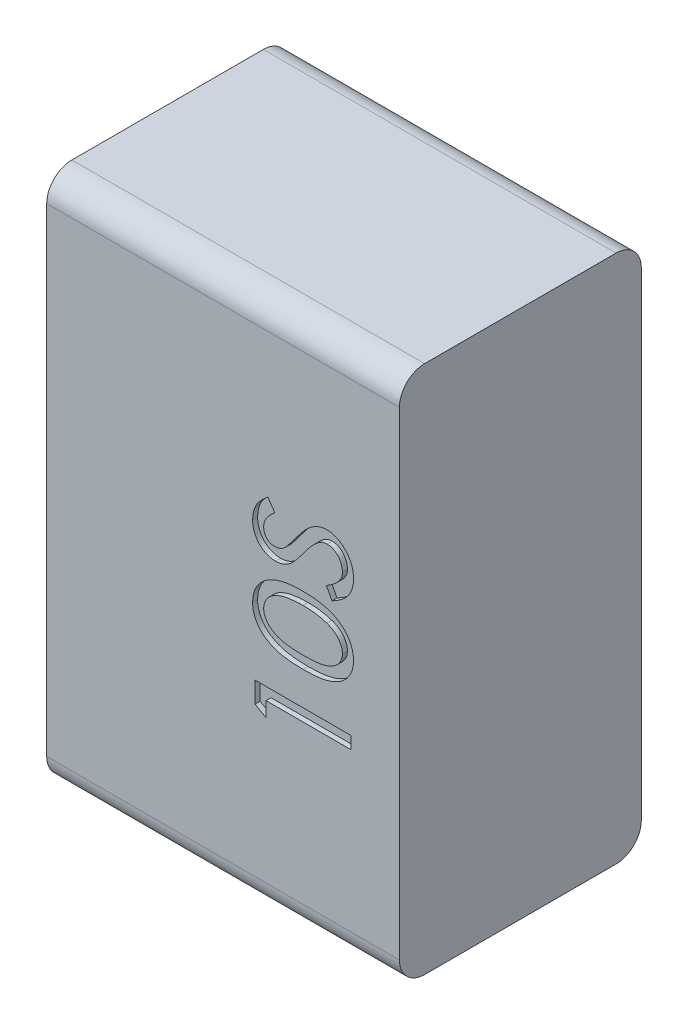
from build123d import *

# Parameters (mm, degrees)
ESQUISSE1_W             = 70
ESQUISSE1_H             = 105
BOSS_EXTRU_1_DEPTH      = 24
CONG_1_R                = 5
ENL_V_MAT_EXTRU_1_DEPTH = 1


with BuildPart() as part:
    # Esquisse1 → Boss.-Extru.1 (new, symmetric)
    with BuildSketch(Plane.XY):
        Rectangle(ESQUISSE1_W, ESQUISSE1_H)
    extrude(amount=BOSS_EXTRU_1_DEPTH, both=True)

    # Cong_1
    cong_1_edges = [part.edges().sort_by_distance(p)[0] for p in [
        (0, -52.5, 24),
        (0, 52.5, 24),
        (0, -52.5, -24),
        (0, 52.5, -24),
    ]]
    fillet(cong_1_edges, radius=CONG_1_R)

    # Esquisse2 → Enl_v. mat.-Extru.1 (cut)
    # profile 1 of 3: a face of its own
    with BuildSketch(Plane.XY.offset(24)):
        with BuildLine():
            Line((21.619497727, 7.537951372), (20.512827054, 9.61391291))
            add(Edge.make_bspline(
                [(20.512827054, 9.61391291), (20.763422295, 9.765199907), (21.242379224, 10.054351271), (21.887591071, 10.529152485), (22.437787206, 11.001233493), (22.8924121, 11.475254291), (23.244163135, 11.957799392), (23.498380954, 12.443942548), (23.658165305, 12.93672643), (23.678046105, 13.269913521), (23.687827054, 13.433834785)],
                knots=[0, 0, 0, 0, 1.354943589, 2.589672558, 3.704607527, 4.708856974, 5.624398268, 6.459549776, 7.242129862, 8, 8, 8, 8], degree=3))
            add(Edge.make_bspline(
                [(23.687827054, 13.433834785), (23.682932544, 13.586874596), (23.673237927, 13.890002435), (23.588383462, 14.335206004), (23.460840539, 14.767507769), (23.27212947, 15.175393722), (23.047993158, 15.553338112), (22.785056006, 15.889877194), (22.482175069, 16.171912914), (22.14883514, 16.405921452), (21.793390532, 16.587849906), (21.425460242, 16.725066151), (21.042657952, 16.802323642), (20.784093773, 16.813232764), (20.654022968, 16.818720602)],
                knots=[0, 0, 0, 0, 1.088997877, 2.156991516, 3.217388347, 4.291818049, 5.34833773, 6.341591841, 7.322247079, 8.284867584, 9.233012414, 10.158731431, 11.073749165, 12, 12, 12, 12], degree=3))
            add(Edge.make_bspline(
                [(20.654022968, 16.818720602), (20.505743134, 16.811237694), (20.206103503, 16.796116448), (19.760985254, 16.674749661), (19.320222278, 16.477506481), (19.045026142, 16.295052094), (18.902430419, 16.200511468)],
                knots=[0, 0, 0, 0, 0.941861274, 1.903286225, 2.913566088, 4, 4, 4, 4], degree=3))
            add(Edge.make_bspline(
                [(18.902430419, 16.200511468), (18.798617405, 16.118774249), (18.580082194, 15.946710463), (18.2513591, 15.655191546), (17.907748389, 15.315903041), (17.556440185, 14.921988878), (17.175181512, 14.494264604), (16.78878867, 14.010828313), (16.383615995, 13.483603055), (16.112139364, 13.11382289), (15.971661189, 12.922476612)],
                knots=[0, 0, 0, 0, 0.718605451, 1.5127255, 2.388525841, 3.34361075, 4.383114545, 5.504804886, 6.708837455, 8, 8, 8, 8], degree=3))
            add(Edge.make_bspline(
                [(15.971661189, 12.922476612), (15.829833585, 12.727381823), (15.557706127, 12.353049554), (15.158766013, 11.825648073), (14.790921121, 11.352781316), (14.453883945, 10.938075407), (14.144725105, 10.581483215), (13.864713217, 10.283755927), (13.621532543, 10.03593072), (13.457909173, 9.902756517), (13.384341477, 9.842879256)],
                knots=[0, 0, 0, 0, 1.435833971, 2.754963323, 3.936484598, 5.002077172, 5.935979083, 6.744956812, 7.435712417, 8, 8, 8, 8], degree=3))
            add(Edge.make_bspline(
                [(13.384341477, 9.842879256), (13.271395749, 9.755466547), (13.049504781, 9.583737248), (12.693577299, 9.36632201), (12.332991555, 9.179241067), (11.964408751, 9.025152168), (11.589006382, 8.905742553), (11.205467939, 8.823594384), (10.815316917, 8.765648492), (10.551732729, 8.761294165), (10.419227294, 8.759105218)],
                knots=[0, 0, 0, 0, 1.064105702, 2.090521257, 3.104283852, 4.09061442, 5.065433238, 6.036507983, 7.012940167, 8, 8, 8, 8], degree=3))
            add(Edge.make_bspline(
                [(10.419227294, 8.759105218), (10.212571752, 8.76595527), (9.803408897, 8.779517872), (9.205179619, 8.902353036), (8.63417238, 9.09827764), (8.095517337, 9.369343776), (7.598546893, 9.712262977), (7.156415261, 10.124741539), (6.770775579, 10.600416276), (6.446228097, 11.132681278), (6.182777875, 11.70607373), (5.995061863, 12.310077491), (5.881247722, 12.937264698), (5.866458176, 13.363401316), (5.8589809, 13.578846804)],
                knots=[0, 0, 0, 0, 1.004420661, 1.988679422, 2.957408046, 3.934344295, 4.912808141, 5.884871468, 6.865856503, 7.882630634, 8.910008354, 9.927798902, 10.952339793, 12, 12, 12, 12], degree=3))
            add(Edge.make_bspline(
                [(5.8589809, 13.578846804), (5.867195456, 13.82357897), (5.883471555, 14.308484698), (6.008896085, 15.020950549), (6.21264717, 15.70584807), (6.447951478, 16.255013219), (6.686479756, 16.682349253), (6.902203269, 17.005483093), (7.146259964, 17.336699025), (7.430911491, 17.665480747), (7.742357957, 18.004649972), (8.097537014, 18.33683633), (8.476090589, 18.683062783), (8.749093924, 18.90373483), (8.888968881, 19.016797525)],
                knots=[0, 0, 0, 0, 1.360687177, 2.696028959, 4.010076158, 5.328383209, 6.009416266, 6.72960499, 7.488083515, 8.296188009, 9.147227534, 10.04798982, 10.999875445, 12, 12, 12, 12], degree=3))
            Line((8.888968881, 19.016797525), (10.255134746, 17.024790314))
            add(Edge.make_bspline(
                [(10.255134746, 17.024790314), (10.144140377, 16.920829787), (9.930726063, 16.720939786), (9.628007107, 16.426954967), (9.356567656, 16.148630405), (9.116641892, 15.885882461), (8.906713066, 15.641550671), (8.724550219, 15.417776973), (8.579444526, 15.205545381), (8.42241217, 14.951257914), (8.275337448, 14.632332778), (8.14676527, 14.240915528), (8.074060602, 13.832113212), (8.062769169, 13.554947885), (8.057057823, 13.414754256)],
                knots=[0, 0, 0, 0, 1.253107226, 2.40941069, 3.47678296, 4.456123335, 5.340621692, 6.131268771, 6.831968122, 7.457534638, 8.592258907, 9.715940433, 10.844694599, 12, 12, 12, 12], degree=3))
            add(Edge.make_bspline(
                [(8.057057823, 13.414754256), (8.06404968, 13.265138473), (8.077642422, 12.974273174), (8.194041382, 12.556460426), (8.37771497, 12.172389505), (8.637662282, 11.833531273), (8.959407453, 11.551882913), (9.336291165, 11.345327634), (9.765800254, 11.224445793), (10.067354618, 11.209307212), (10.2246059, 11.20141291)],
                knots=[0, 0, 0, 0, 1.033513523, 2.009234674, 2.977584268, 3.963375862, 4.942860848, 5.915719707, 6.913112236, 8, 8, 8, 8], degree=3))
            add(Edge.make_bspline(
                [(10.2246059, 11.20141291), (10.326499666, 11.204488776), (10.530040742, 11.210633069), (10.831542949, 11.255764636), (11.122865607, 11.339190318), (11.410149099, 11.444907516), (11.691779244, 11.592875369), (11.968200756, 11.781321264), (12.247377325, 12.005023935), (12.422881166, 12.176707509), (12.514269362, 12.26610642)],
                knots=[0, 0, 0, 0, 0.940834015, 1.879392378, 2.805520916, 3.734846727, 4.701501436, 5.734192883, 6.820151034, 8, 8, 8, 8], degree=3))
            add(Edge.make_bspline(
                [(12.514269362, 12.26610642), (12.556853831, 12.311372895), (12.654594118, 12.415268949), (12.804263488, 12.60582547), (12.991908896, 12.837988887), (13.214467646, 13.114977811), (13.459856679, 13.445900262), (13.744470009, 13.818520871), (14.055494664, 14.24227442), (14.273544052, 14.540470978), (14.387977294, 14.696965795)],
                knots=[0, 0, 0, 0, 0.485581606, 1.114511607, 1.892484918, 2.819534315, 3.891398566, 5.11240712, 6.484579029, 8, 8, 8, 8], degree=3))
            add(Edge.make_bspline(
                [(14.387977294, 14.696965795), (14.543383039, 14.910172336), (14.844020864, 15.322627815), (15.29749346, 15.908534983), (15.742008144, 16.436940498), (16.162056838, 16.921203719), (16.575259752, 17.344947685), (16.973120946, 17.716111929), (17.351756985, 18.039357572), (17.834507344, 18.384587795), (18.429655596, 18.729748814), (19.149004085, 19.038394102), (19.874027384, 19.222572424), (20.357938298, 19.248320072), (20.596781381, 19.261028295)],
                knots=[0, 0, 0, 0, 1.186540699, 2.295404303, 3.331123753, 4.291760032, 5.17774712, 5.991329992, 6.738459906, 7.414799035, 8.65800623, 9.82461674, 10.926299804, 12, 12, 12, 12], degree=3))
            add(Edge.make_bspline(
                [(20.596781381, 19.261028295), (20.766237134, 19.255621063), (21.103043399, 19.244873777), (21.601031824, 19.166950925), (22.085064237, 19.037299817), (22.55307396, 18.850752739), (23.009540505, 18.618149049), (23.450136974, 18.329443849), (23.873765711, 17.987531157), (24.27864491, 17.601063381), (24.654906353, 17.178498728), (24.984328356, 16.721900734), (25.265897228, 16.239882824), (25.488930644, 15.728547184), (25.671904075, 15.196169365), (25.796881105, 14.635659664), (25.869103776, 14.050129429), (25.880244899, 13.651553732), (25.885903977, 13.449099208)],
                knots=[0, 0, 0, 0, 0.932738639, 1.853889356, 2.767877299, 3.686041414, 4.622558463, 5.584089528, 6.580490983, 7.61578374, 8.662665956, 9.690923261, 10.710750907, 11.729736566, 12.757349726, 13.805636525, 14.885384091, 16, 16, 16, 16], degree=3))
            add(Edge.make_bspline(
                [(25.885903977, 13.449099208), (25.882624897, 13.301467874), (25.876166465, 13.010695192), (25.835199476, 12.57902058), (25.756461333, 12.158947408), (25.654660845, 11.748172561), (25.52503167, 11.346439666), (25.35921219, 10.958925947), (25.1687456, 10.579178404), (24.945728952, 10.20937545), (24.68459402, 9.849045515), (24.381467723, 9.496140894), (24.031021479, 9.152711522), (23.63780832, 8.812870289), (23.197405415, 8.481106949), (22.712128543, 8.15819604), (22.183542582, 7.840014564), (21.811218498, 7.640623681), (21.619497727, 7.537951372)],
                knots=[0, 0, 0, 0, 0.916943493, 1.805999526, 2.689245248, 3.568702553, 4.433092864, 5.307568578, 6.183755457, 7.069823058, 7.986358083, 8.944343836, 9.955449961, 11.030835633, 12.170024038, 13.377301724, 14.649494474, 16, 16, 16, 16], degree=3))
        make_face()
    # profile 2 of 3: a face of its own
    with BuildSketch(Plane.XY.offset(24)):
        with BuildLine():
            add(Edge.make_bspline(
                [(15.88007465, -7.115894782), (15.577292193, -7.114079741), (14.989276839, -7.11055486), (14.13387484, -7.072462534), (13.330916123, -7.006976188), (12.579288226, -6.922014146), (11.880434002, -6.807011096), (11.232758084, -6.67117176), (10.63679936, -6.508958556), (10.090809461, -6.316169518), (9.586516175, -6.100922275), (9.117007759, -5.863682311), (8.675867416, -5.608526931), (8.266140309, -5.329531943), (7.888358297, -5.027295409), (7.538532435, -4.70622178), (7.220882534, -4.361497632), (6.935107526, -3.996339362), (6.684325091, -3.613022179), (6.460101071, -3.221335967), (6.278305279, -2.813374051), (6.123854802, -2.397250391), (6.005688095, -1.969415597), (5.922681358, -1.530295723), (5.865648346, -1.081587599), (5.861211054, -0.7775208), (5.8589809, -0.624698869)],
                knots=[0, 0, 0, 0, 1.622324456, 3.150617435, 4.586648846, 5.938510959, 7.202478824, 8.380218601, 9.483160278, 10.509271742, 11.480323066, 12.419168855, 13.326330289, 14.209199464, 15.072487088, 15.916592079, 16.751065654, 17.581409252, 18.398072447, 19.203768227, 19.996882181, 20.788266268, 21.580354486, 22.37170922, 23.181631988, 24, 24, 24, 24], degree=3))
            add(Edge.make_bspline(
                [(5.8589809, -0.624698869), (5.863211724, -0.457950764), (5.871562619, -0.128819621), (5.921001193, 0.358786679), (6.007696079, 0.832725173), (6.137001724, 1.291705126), (6.290689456, 1.740263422), (6.487277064, 2.172005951), (6.717982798, 2.589703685), (6.979781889, 2.994484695), (7.279550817, 3.378982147), (7.605573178, 3.748175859), (7.972546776, 4.084969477), (8.360073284, 4.410354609), (8.787449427, 4.70000195), (9.237099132, 4.979684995), (9.725175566, 5.22381816), (10.240985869, 5.457008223), (10.798186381, 5.657067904), (11.39441288, 5.838990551), (12.036504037, 5.984641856), (12.721567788, 6.107132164), (13.450114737, 6.200877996), (14.22145768, 6.270247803), (15.036369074, 6.306434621), (15.593835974, 6.313281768), (15.88007465, 6.316797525)],
                knots=[0, 0, 0, 0, 0.874933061, 1.72696246, 2.568656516, 3.399270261, 4.226687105, 5.054103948, 5.884503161, 6.728628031, 7.580317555, 8.440515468, 9.309317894, 10.191197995, 11.092808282, 12.015369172, 12.967534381, 13.953506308, 14.983858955, 16.071232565, 17.222283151, 18.435872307, 19.721483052, 21.074976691, 22.498108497, 24, 24, 24, 24], degree=3))
            add(Edge.make_bspline(
                [(15.88007465, 6.316797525), (16.165037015, 6.313245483), (16.719952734, 6.306328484), (17.531113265, 6.27065345), (18.298267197, 6.199513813), (19.023584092, 6.11197471), (19.704804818, 5.98900043), (20.341293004, 5.840161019), (20.936957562, 5.671271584), (21.488193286, 5.465632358), (22.005173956, 5.24193738), (22.488154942, 4.990967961), (22.944263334, 4.723525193), (23.362977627, 4.421220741), (23.76032445, 4.108098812), (24.116731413, 3.760003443), (24.453595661, 3.399731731), (24.747717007, 3.008474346), (25.016579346, 2.604637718), (25.250755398, 2.184364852), (25.444561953, 1.747915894), (25.605200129, 1.300232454), (25.733861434, 0.83908558), (25.818778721, 0.36232533), (25.874478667, -0.127294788), (25.882072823, -0.457908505), (25.885903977, -0.624698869)],
                knots=[0, 0, 0, 0, 1.496746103, 2.914658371, 4.26288044, 5.542326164, 6.750579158, 7.896298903, 8.974586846, 9.99971989, 10.984004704, 11.931200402, 12.856972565, 13.757870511, 14.641611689, 15.511045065, 16.371655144, 17.229512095, 18.07816251, 18.918488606, 19.75284466, 20.583340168, 21.414802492, 22.263926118, 23.124173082, 24, 24, 24, 24], degree=3))
            add(Edge.make_bspline(
                [(25.885903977, -0.624698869), (25.883286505, -0.778747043), (25.878102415, -1.083850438), (25.827255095, -1.53438339), (25.742874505, -1.973271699), (25.624582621, -2.399204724), (25.474501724, -2.815255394), (25.292312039, -3.21931906), (25.072822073, -3.610485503), (24.820671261, -3.987487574), (24.539397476, -4.350039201), (24.225353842, -4.692290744), (23.874256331, -5.008014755), (23.497951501, -5.310552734), (23.087392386, -5.590438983), (22.643041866, -5.844555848), (22.168109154, -6.082264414), (21.65887995, -6.299918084), (21.110035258, -6.498401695), (20.509828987, -6.657644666), (19.863023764, -6.805951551), (19.162512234, -6.915464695), (18.414578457, -7.010323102), (17.614425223, -7.065390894), (16.764689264, -7.112437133), (16.180352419, -7.114721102), (15.88007465, -7.115894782)],
                knots=[0, 0, 0, 0, 0.826192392, 1.636332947, 2.428658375, 3.221718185, 4.00532592, 4.799412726, 5.596806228, 6.40878423, 7.230568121, 8.056422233, 8.896948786, 9.761295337, 10.645247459, 11.559424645, 12.505520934, 13.492996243, 14.529078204, 15.633372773, 16.82213518, 18.087653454, 19.435208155, 20.865661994, 22.389333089, 24, 24, 24, 24], degree=3))
        make_face()
        with BuildLine():
            add(Edge.make_bspline(
                [(15.872442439, -4.67358709), (16.128151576, -4.672606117), (16.623185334, -4.670707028), (17.33952091, -4.64250855), (18.006541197, -4.602361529), (18.624065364, -4.542308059), (19.193011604, -4.462228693), (19.712594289, -4.367446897), (20.183808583, -4.259381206), (20.607429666, -4.127631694), (20.993412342, -3.981748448), (21.348765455, -3.819553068), (21.681505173, -3.651112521), (21.985155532, -3.461467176), (22.263444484, -3.260288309), (22.516108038, -3.04605314), (22.744204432, -2.820603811), (23.001942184, -2.503428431), (23.275243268, -2.097759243), (23.507920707, -1.590786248), (23.662268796, -1.081446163), (23.679362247, -0.737688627), (23.687827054, -0.567457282)],
                knots=[0, 0, 0, 0, 1.564699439, 3.029141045, 4.386293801, 5.653467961, 6.824775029, 7.901162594, 8.884869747, 9.78110004, 10.613826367, 11.40815699, 12.170610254, 12.894246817, 13.596465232, 14.27023614, 14.919737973, 15.555616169, 16.768951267, 17.900875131, 18.960497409, 20, 20, 20, 20], degree=3))
            add(Edge.make_bspline(
                [(23.687827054, -0.567457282), (23.677643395, -0.374602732), (23.65733945, 0.009906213), (23.512048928, 0.577433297), (23.26039325, 1.118541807), (22.983619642, 1.549834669), (22.71341578, 1.875126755), (22.483396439, 2.108438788), (22.230100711, 2.327492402), (21.950383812, 2.530290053), (21.643465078, 2.71528868), (21.31577754, 2.893338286), (20.959834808, 3.048451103), (20.711782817, 3.138082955), (20.585333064, 3.183774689)],
                knots=[0, 0, 0, 0, 1.332227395, 2.656164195, 4.017280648, 5.441181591, 6.18399097, 6.936103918, 7.702666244, 8.495636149, 9.320275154, 10.177577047, 11.070981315, 12, 12, 12, 12], degree=3))
            add(Edge.make_bspline(
                [(20.585333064, 3.183774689), (20.419197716, 3.238824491), (20.080519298, 3.351047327), (19.553219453, 3.491647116), (18.999923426, 3.608046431), (18.423577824, 3.70827273), (17.821279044, 3.784374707), (17.193607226, 3.83697716), (16.540558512, 3.867150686), (16.097623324, 3.872016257), (15.872442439, 3.874489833)],
                knots=[0, 0, 0, 0, 0.877617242, 1.789083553, 2.735016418, 3.71249782, 4.722174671, 5.778575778, 6.870664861, 8, 8, 8, 8], degree=3))
            add(Edge.make_bspline(
                [(15.872442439, 3.874489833), (15.647238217, 3.873899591), (15.208052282, 3.872748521), (14.565635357, 3.838408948), (13.954122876, 3.796996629), (13.374353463, 3.724941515), (12.824423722, 3.645650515), (12.308633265, 3.535238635), (11.822762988, 3.417499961), (11.371867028, 3.269921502), (10.951669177, 3.110367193), (10.561363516, 2.937071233), (10.196729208, 2.758130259), (9.868581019, 2.552014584), (9.565924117, 2.34030445), (9.293028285, 2.113011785), (9.046737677, 1.874836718), (8.774161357, 1.536241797), (8.488202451, 1.103639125), (8.238913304, 0.558557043), (8.087240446, -0.00087767), (8.067066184, -0.379583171), (8.057057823, -0.567457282)],
                knots=[0, 0, 0, 0, 1.352991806, 2.638560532, 3.86496067, 5.034895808, 6.148335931, 7.202173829, 8.203243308, 9.150794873, 10.050786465, 10.902929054, 11.716489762, 12.488637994, 13.228798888, 13.934409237, 14.620839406, 15.283406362, 16.542711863, 17.72627546, 18.872015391, 20, 20, 20, 20], degree=3))
            add(Edge.make_bspline(
                [(8.057057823, -0.567457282), (8.06562129, -0.737668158), (8.0829757, -1.082611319), (8.236088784, -1.591757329), (8.465652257, -2.097684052), (8.736247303, -2.501148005), (8.993200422, -2.816621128), (9.220036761, -3.042255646), (9.474009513, -3.252635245), (9.753069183, -3.44996946), (10.056655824, -3.639135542), (10.387389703, -3.812772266), (10.744013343, -3.973754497), (11.129720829, -4.120301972), (11.553974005, -4.250920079), (12.02568221, -4.364112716), (12.546134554, -4.463916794), (13.117398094, -4.537070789), (13.735881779, -4.597987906), (14.403941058, -4.643700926), (15.121719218, -4.670360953), (15.616740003, -4.672488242), (15.872442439, -4.67358709)],
                knots=[0, 0, 0, 0, 1.039577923, 2.106770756, 3.228450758, 4.431088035, 5.067012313, 5.716561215, 6.385370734, 7.083094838, 7.806783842, 8.572900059, 9.367288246, 10.200074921, 11.096370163, 12.081964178, 13.167511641, 14.337842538, 15.605108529, 16.970639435, 18.435187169, 20, 20, 20, 20], degree=3))
        make_face(mode=Mode.SUBTRACT)
    # profile 3 of 3: a face of its own
    with BuildSketch(Plane.XY.offset(24)):
        Polygon((6.347442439, -17.854416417), (6.347442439, -13.710125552), (25.397442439, -13.710125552), (25.397442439, -16.152433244), (8.545519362, -16.152433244), (8.545519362, -19.083202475), align=None)
    extrude(amount=-ENL_V_MAT_EXTRU_1_DEPTH, mode=Mode.SUBTRACT)


solid = part.part
